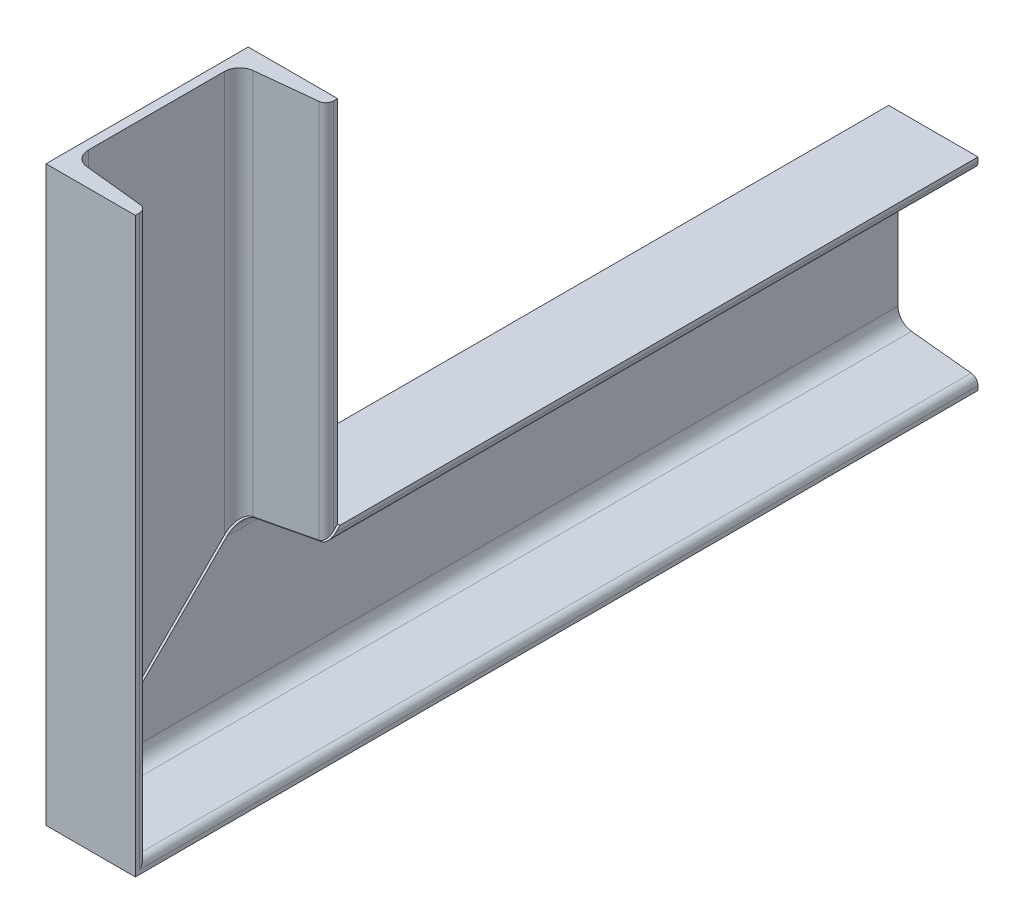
ISO-10303-21;
HEADER;
FILE_DESCRIPTION(('STEP AP214'),'2;1');
FILE_NAME('part.step','',(''),(''),'','','');
FILE_SCHEMA(('AUTOMOTIVE_DESIGN { 1 0 10303 214 1 1 1 1 }'));
ENDSEC;
DATA;
#1=APPLICATION_CONTEXT('core data for automotive mechanical design processes');
#2=APPLICATION_PROTOCOL_DEFINITION('international standard','automotive_design',2000,#1);
#3=PRODUCT_CONTEXT('',#1,'mechanical');
#4=PRODUCT('Part','Part','',(#3));
#5=PRODUCT_RELATED_PRODUCT_CATEGORY('part','',(#4));
#6=PRODUCT_DEFINITION_FORMATION('','',#4);
#7=PRODUCT_DEFINITION_CONTEXT('part definition',#1,'design');
#8=PRODUCT_DEFINITION('design','',#6,#7);
#9=PRODUCT_DEFINITION_SHAPE('','',#8);
#10=(LENGTH_UNIT() NAMED_UNIT(*) SI_UNIT(.MILLI.,.METRE.));
#11=(NAMED_UNIT(*) PLANE_ANGLE_UNIT() SI_UNIT($,.RADIAN.));
#12=(NAMED_UNIT(*) SI_UNIT($,.STERADIAN.) SOLID_ANGLE_UNIT());
#13=UNCERTAINTY_MEASURE_WITH_UNIT(LENGTH_MEASURE(1.E-05),#10,'distance_accuracy_value','');
#14=(GEOMETRIC_REPRESENTATION_CONTEXT(3) GLOBAL_UNCERTAINTY_ASSIGNED_CONTEXT((#13)) GLOBAL_UNIT_ASSIGNED_CONTEXT((#10,
#11,#12)) REPRESENTATION_CONTEXT('',''));
#15=CARTESIAN_POINT('',(0.,0.,0.));
#16=DIRECTION('',(0.,0.,1.));
#17=DIRECTION('',(1.,0.,0.));
#18=AXIS2_PLACEMENT_3D('',#15,#16,#17);
#19=CARTESIAN_POINT('',(53.,57.5511778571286,500.));
#20=DIRECTION('',(-1.,0.,0.));
#21=DIRECTION('',(0.,0.,1.));
#22=AXIS2_PLACEMENT_3D('',#19,#20,#21);
#23=PLANE('',#22);
#24=DIRECTION('',(0.,0.,-1.));
#25=VECTOR('',#24,1.);
#26=CARTESIAN_POINT('',(53.,60.,500.));
#27=LINE('',#26,#25);
#28=CARTESIAN_POINT('',(53.,60.,378.585786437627));
#29=VERTEX_POINT('',#28);
#30=CARTESIAN_POINT('',(53.,60.,0.));
#31=VERTEX_POINT('',#30);
#32=EDGE_CURVE('E353',#29,#31,#27,.T.);
#33=ORIENTED_EDGE('',*,*,#32,.F.);
#34=DIRECTION('',(0.,-0.707106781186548,0.707106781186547));
#35=VECTOR('',#34,1.);
#36=CARTESIAN_POINT('',(53.,-1.93151785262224,440.517304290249));
#37=LINE('',#36,#35);
#38=CARTESIAN_POINT('',(53.,57.5511778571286,381.034608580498));
#39=VERTEX_POINT('',#38);
#40=EDGE_CURVE('E238',#29,#39,#37,.T.);
#41=ORIENTED_EDGE('',*,*,#40,.T.);
#42=DIRECTION('',(0.,0.,-1.));
#43=VECTOR('',#42,1.);
#44=CARTESIAN_POINT('',(53.,57.5511778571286,500.));
#45=LINE('',#44,#43);
#46=CARTESIAN_POINT('',(53.,57.5511778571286,0.));
#47=VERTEX_POINT('',#46);
#48=EDGE_CURVE('E355',#39,#47,#45,.T.);
#49=ORIENTED_EDGE('',*,*,#48,.T.);
#50=DIRECTION('',(0.,1.,0.));
#51=VECTOR('',#50,1.);
#52=CARTESIAN_POINT('',(53.,57.5511778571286,0.));
#53=LINE('',#52,#51);
#54=EDGE_CURVE('E345',#47,#31,#53,.T.);
#55=ORIENTED_EDGE('',*,*,#54,.T.);
#56=EDGE_LOOP('',(#33,#41,#49,#55));
#57=FACE_BOUND('',#56,.T.);
#58=ADVANCED_FACE('F41',(#57),#23,.F.);
#59=DIRECTION('',(0.,0.,-1.));
#60=VECTOR('',#59,1.);
#61=CARTESIAN_POINT('',(53.,-57.5511778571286,500.));
#62=LINE('',#61,#60);
#63=CARTESIAN_POINT('',(53.,-57.5511778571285,497.551177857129));
#64=VERTEX_POINT('',#63);
#65=CARTESIAN_POINT('',(53.,-57.5511778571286,0.));
#66=VERTEX_POINT('',#65);
#67=EDGE_CURVE('E369',#64,#66,#62,.T.);
#68=ORIENTED_EDGE('',*,*,#67,.F.);
#69=DIRECTION('',(0.,-1.,0.));
#70=VECTOR('',#69,1.);
#71=CARTESIAN_POINT('',(53.,280.,497.551177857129));
#72=LINE('',#71,#70);
#73=CARTESIAN_POINT('',(53.,280.,497.551177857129));
#74=VERTEX_POINT('',#73);
#75=EDGE_CURVE('E279',#74,#64,#72,.T.);
#76=ORIENTED_EDGE('',*,*,#75,.F.);
#77=DIRECTION('',(0.,0.,1.));
#78=VECTOR('',#77,1.);
#79=CARTESIAN_POINT('',(53.,280.,497.551177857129));
#80=LINE('',#79,#78);
#81=CARTESIAN_POINT('',(53.,280.,500.));
#82=VERTEX_POINT('',#81);
#83=EDGE_CURVE('E276',#74,#82,#80,.T.);
#84=ORIENTED_EDGE('',*,*,#83,.T.);
#85=DIRECTION('',(0.,1.,0.));
#86=VECTOR('',#85,1.);
#87=CARTESIAN_POINT('',(53.,-60.,500.));
#88=LINE('',#87,#86);
#89=CARTESIAN_POINT('',(53.,-60.,500.));
#90=VERTEX_POINT('',#89);
#91=EDGE_CURVE('E351',#90,#82,#88,.T.);
#92=ORIENTED_EDGE('',*,*,#91,.F.);
#93=DIRECTION('',(0.,0.,-1.));
#94=VECTOR('',#93,1.);
#95=CARTESIAN_POINT('',(53.,-60.,500.));
#96=LINE('',#95,#94);
#97=CARTESIAN_POINT('',(53.,-60.,0.));
#98=VERTEX_POINT('',#97);
#99=EDGE_CURVE('E371',#90,#98,#96,.T.);
#100=ORIENTED_EDGE('',*,*,#99,.T.);
#101=DIRECTION('',(0.,1.,0.));
#102=VECTOR('',#101,1.);
#103=CARTESIAN_POINT('',(53.,-60.,0.));
#104=LINE('',#103,#102);
#105=EDGE_CURVE('E321',#98,#66,#104,.T.);
#106=ORIENTED_EDGE('',*,*,#105,.T.);
#107=EDGE_LOOP('',(#68,#76,#84,#92,#100,#106));
#108=FACE_BOUND('',#107,.T.);
#109=ADVANCED_FACE('F417',(#108),#23,.F.);
#110=DIRECTION('',(0.,-1.,0.));
#111=VECTOR('',#110,1.);
#112=CARTESIAN_POINT('',(53.,280.,382.448822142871));
#113=LINE('',#112,#111);
#114=CARTESIAN_POINT('',(53.,280.,382.448822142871));
#115=VERTEX_POINT('',#114);
#116=CARTESIAN_POINT('',(53.,58.9653914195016,382.448822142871));
#117=VERTEX_POINT('',#116);
#118=EDGE_CURVE('E297',#115,#117,#113,.T.);
#119=ORIENTED_EDGE('',*,*,#118,.T.);
#120=DIRECTION('',(0.,0.707106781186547,-0.707106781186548));
#121=VECTOR('',#120,1.);
#122=CARTESIAN_POINT('',(53.,-0.517304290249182,441.931517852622));
#123=LINE('',#122,#121);
#124=CARTESIAN_POINT('',(53.,61.4142135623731,380.));
#125=VERTEX_POINT('',#124);
#126=EDGE_CURVE('E218',#117,#125,#123,.T.);
#127=ORIENTED_EDGE('',*,*,#126,.T.);
#128=DIRECTION('',(0.,-1.,0.));
#129=VECTOR('',#128,1.);
#130=CARTESIAN_POINT('',(53.,280.,380.));
#131=LINE('',#130,#129);
#132=CARTESIAN_POINT('',(53.,280.,380.));
#133=VERTEX_POINT('',#132);
#134=EDGE_CURVE('E300',#133,#125,#131,.T.);
#135=ORIENTED_EDGE('',*,*,#134,.F.);
#136=DIRECTION('',(0.,0.,1.));
#137=VECTOR('',#136,1.);
#138=CARTESIAN_POINT('',(53.,280.,380.));
#139=LINE('',#138,#137);
#140=EDGE_CURVE('E252',#133,#115,#139,.T.);
#141=ORIENTED_EDGE('',*,*,#140,.T.);
#142=EDGE_LOOP('',(#119,#127,#135,#141));
#143=FACE_BOUND('',#142,.T.);
#144=ADVANCED_FACE('F447',(#143),#23,.F.);
#145=CARTESIAN_POINT('',(53.,60.,500.));
#146=DIRECTION('',(0.,-1.,0.));
#147=DIRECTION('',(0.,0.,-1.));
#148=AXIS2_PLACEMENT_3D('',#145,#146,#147);
#149=PLANE('',#148);
#150=DIRECTION('',(0.,0.,-1.));
#151=VECTOR('',#150,1.);
#152=CARTESIAN_POINT('',(0.,60.,500.));
#153=LINE('',#152,#151);
#154=CARTESIAN_POINT('',(0.,60.,378.585786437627));
#155=VERTEX_POINT('',#154);
#156=CARTESIAN_POINT('',(0.,60.,0.));
#157=VERTEX_POINT('',#156);
#158=EDGE_CURVE('E375',#155,#157,#153,.T.);
#159=ORIENTED_EDGE('',*,*,#158,.F.);
#160=DIRECTION('',(1.,0.,0.));
#161=VECTOR('',#160,1.);
#162=CARTESIAN_POINT('',(53.,60.,378.585786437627));
#163=LINE('',#162,#161);
#164=EDGE_CURVE('E241',#155,#29,#163,.T.);
#165=ORIENTED_EDGE('',*,*,#164,.T.);
#166=ORIENTED_EDGE('',*,*,#32,.T.);
#167=DIRECTION('',(-1.,0.,0.));
#168=VECTOR('',#167,1.);
#169=CARTESIAN_POINT('',(53.,60.,0.));
#170=LINE('',#169,#168);
#171=EDGE_CURVE('E312',#31,#157,#170,.T.);
#172=ORIENTED_EDGE('',*,*,#171,.T.);
#173=EDGE_LOOP('',(#159,#165,#166,#172));
#174=FACE_BOUND('',#173,.T.);
#175=ADVANCED_FACE('F43',(#174),#149,.F.);
#176=CARTESIAN_POINT('',(0.,60.,500.));
#177=DIRECTION('',(1.,0.,0.));
#178=DIRECTION('',(0.,1.,0.));
#179=AXIS2_PLACEMENT_3D('',#176,#177,#178);
#180=PLANE('',#179);
#181=DIRECTION('',(0.,0.707106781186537,0.707106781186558));
#182=VECTOR('',#181,1.);
#183=CARTESIAN_POINT('',(0.,-40.240947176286,478.826733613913));
#184=LINE('',#183,#182);
#185=CARTESIAN_POINT('',(0.,-40.240947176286,478.826733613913));
#186=VERTEX_POINT('',#185);
#187=CARTESIAN_POINT('',(0.,-38.8267336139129,480.240947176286));
#188=VERTEX_POINT('',#187);
#189=EDGE_CURVE('E204',#186,#188,#184,.T.);
#190=ORIENTED_EDGE('',*,*,#189,.F.);
#191=DIRECTION('',(0.,-0.707106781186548,0.707106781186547));
#192=VECTOR('',#191,1.);
#193=CARTESIAN_POINT('',(0.,73.6108187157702,364.974967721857));
#194=LINE('',#193,#192);
#195=EDGE_CURVE('E201',#155,#186,#194,.T.);
#196=ORIENTED_EDGE('',*,*,#195,.F.);
#197=ORIENTED_EDGE('',*,*,#158,.T.);
#198=DIRECTION('',(0.,-1.,0.));
#199=VECTOR('',#198,1.);
#200=CARTESIAN_POINT('',(0.,60.,0.));
#201=LINE('',#200,#199);
#202=CARTESIAN_POINT('',(0.,-60.,0.));
#203=VERTEX_POINT('',#202);
#204=EDGE_CURVE('E315',#157,#203,#201,.T.);
#205=ORIENTED_EDGE('',*,*,#204,.T.);
#206=DIRECTION('',(0.,0.,-1.));
#207=VECTOR('',#206,1.);
#208=CARTESIAN_POINT('',(0.,-60.,500.));
#209=LINE('',#208,#207);
#210=CARTESIAN_POINT('',(0.,-60.,500.));
#211=VERTEX_POINT('',#210);
#212=EDGE_CURVE('E373',#211,#203,#209,.T.);
#213=ORIENTED_EDGE('',*,*,#212,.F.);
#214=DIRECTION('',(0.,-1.,0.));
#215=VECTOR('',#214,1.);
#216=CARTESIAN_POINT('',(0.,60.,500.));
#217=LINE('',#216,#215);
#218=CARTESIAN_POINT('',(0.,280.,500.));
#219=VERTEX_POINT('',#218);
#220=EDGE_CURVE('E348',#219,#211,#217,.T.);
#221=ORIENTED_EDGE('',*,*,#220,.F.);
#222=DIRECTION('',(0.,0.,-1.));
#223=VECTOR('',#222,1.);
#224=CARTESIAN_POINT('',(0.,280.,500.));
#225=LINE('',#224,#223);
#226=CARTESIAN_POINT('',(0.,280.,380.));
#227=VERTEX_POINT('',#226);
#228=EDGE_CURVE('E247',#219,#227,#225,.T.);
#229=ORIENTED_EDGE('',*,*,#228,.T.);
#230=DIRECTION('',(0.,-1.,0.));
#231=VECTOR('',#230,1.);
#232=CARTESIAN_POINT('',(0.,280.,380.));
#233=LINE('',#232,#231);
#234=CARTESIAN_POINT('',(0.,61.414213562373,380.));
#235=VERTEX_POINT('',#234);
#236=EDGE_CURVE('E214',#227,#235,#233,.T.);
#237=ORIENTED_EDGE('',*,*,#236,.T.);
#238=DIRECTION('',(0.,0.707106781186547,-0.707106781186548));
#239=VECTOR('',#238,1.);
#240=CARTESIAN_POINT('',(0.,-38.8267336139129,480.240947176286));
#241=LINE('',#240,#239);
#242=EDGE_CURVE('E56',#188,#235,#241,.T.);
#243=ORIENTED_EDGE('',*,*,#242,.F.);
#244=EDGE_LOOP('',(#190,#196,#197,#205,#213,#221,#229,#237,#243));
#245=FACE_BOUND('',#244,.T.);
#246=ADVANCED_FACE('F212',(#245),#180,.F.);
#247=CARTESIAN_POINT('',(0.,-60.,500.));
#248=DIRECTION('',(0.,1.,0.));
#249=DIRECTION('',(0.,0.,1.));
#250=AXIS2_PLACEMENT_3D('',#247,#248,#249);
#251=PLANE('',#250);
#252=DIRECTION('',(1.,0.,0.));
#253=VECTOR('',#252,1.);
#254=CARTESIAN_POINT('',(0.,-60.,0.));
#255=LINE('',#254,#253);
#256=EDGE_CURVE('E318',#203,#98,#255,.T.);
#257=ORIENTED_EDGE('',*,*,#256,.T.);
#258=ORIENTED_EDGE('',*,*,#99,.F.);
#259=DIRECTION('',(1.,0.,0.));
#260=VECTOR('',#259,1.);
#261=CARTESIAN_POINT('',(0.,-60.,500.));
#262=LINE('',#261,#260);
#263=EDGE_CURVE('E64',#211,#90,#262,.T.);
#264=ORIENTED_EDGE('',*,*,#263,.F.);
#265=ORIENTED_EDGE('',*,*,#212,.T.);
#266=EDGE_LOOP('',(#257,#258,#264,#265));
#267=FACE_BOUND('',#266,.T.);
#268=ADVANCED_FACE('F405',(#267),#251,.F.);
#269=CARTESIAN_POINT('',(48.5,-57.5511778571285,500.));
#270=DIRECTION('',(0.,0.,-1.));
#271=DIRECTION('',(-1.,0.,0.));
#272=AXIS2_PLACEMENT_3D('',#269,#270,#271);
#273=CYLINDRICAL_SURFACE('',#272,4.5);
#274=CARTESIAN_POINT('',(48.5,-57.5511778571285,0.));
#275=DIRECTION('',(0.,0.,1.));
#276=DIRECTION('',(1.,0.,0.));
#277=AXIS2_PLACEMENT_3D('',#274,#275,#276);
#278=CIRCLE('',#277,4.5);
#279=CARTESIAN_POINT('',(48.9710815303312,-53.0759033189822,0.));
#280=VERTEX_POINT('',#279);
#281=EDGE_CURVE('E324',#66,#280,#278,.T.);
#282=ORIENTED_EDGE('',*,*,#281,.T.);
#283=DIRECTION('',(0.,0.,-1.));
#284=VECTOR('',#283,1.);
#285=CARTESIAN_POINT('',(48.9710815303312,-53.0759033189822,500.));
#286=LINE('',#285,#284);
#287=CARTESIAN_POINT('',(48.9710815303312,-53.0759033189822,493.075903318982));
#288=VERTEX_POINT('',#287);
#289=EDGE_CURVE('E367',#288,#280,#286,.T.);
#290=ORIENTED_EDGE('',*,*,#289,.F.);
#291=CARTESIAN_POINT('',(48.5,-57.5511778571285,497.551177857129));
#292=DIRECTION('',(0.,-0.707106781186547,-0.707106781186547));
#293=DIRECTION('',(0.,0.707106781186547,-0.707106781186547));
#294=AXIS2_PLACEMENT_3D('',#291,#292,#293);
#295=ELLIPSE('',#294,6.36396103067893,4.5);
#296=EDGE_CURVE('E281',#288,#64,#295,.T.);
#297=ORIENTED_EDGE('',*,*,#296,.T.);
#298=ORIENTED_EDGE('',*,*,#67,.T.);
#299=EDGE_LOOP('',(#282,#290,#297,#298));
#300=FACE_BOUND('',#299,.T.);
#301=ADVANCED_FACE('F477',(#300),#273,.T.);
#302=CARTESIAN_POINT('',(48.9710815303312,-53.0759033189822,500.));
#303=DIRECTION('',(-0.104684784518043,-0.994505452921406,0.));
#304=DIRECTION('',(0.994505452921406,-0.104684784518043,0.));
#305=AXIS2_PLACEMENT_3D('',#302,#303,#304);
#306=PLANE('',#305);
#307=DIRECTION('',(-0.994505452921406,0.104684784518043,0.));
#308=VECTOR('',#307,1.);
#309=CARTESIAN_POINT('',(48.9710815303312,-53.0759033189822,0.));
#310=LINE('',#309,#308);
#311=CARTESIAN_POINT('',(13.5578369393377,-49.3481933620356,0.));
#312=VERTEX_POINT('',#311);
#313=EDGE_CURVE('E327',#280,#312,#310,.T.);
#314=ORIENTED_EDGE('',*,*,#313,.T.);
#315=DIRECTION('',(0.,0.,-1.));
#316=VECTOR('',#315,1.);
#317=CARTESIAN_POINT('',(13.5578369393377,-49.3481933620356,500.));
#318=LINE('',#317,#316);
#319=CARTESIAN_POINT('',(13.5578369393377,-49.3481933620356,489.348193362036));
#320=VERTEX_POINT('',#319);
#321=EDGE_CURVE('E365',#320,#312,#318,.T.);
#322=ORIENTED_EDGE('',*,*,#321,.F.);
#323=DIRECTION('',(0.989100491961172,-0.104115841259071,0.10411584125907));
#324=VECTOR('',#323,1.);
#325=CARTESIAN_POINT('',(49.6841321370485,-53.1509612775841,493.150961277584));
#326=LINE('',#325,#324);
#327=EDGE_CURVE('E306',#320,#288,#326,.T.);
#328=ORIENTED_EDGE('',*,*,#327,.T.);
#329=ORIENTED_EDGE('',*,*,#289,.T.);
#330=EDGE_LOOP('',(#314,#322,#328,#329));
#331=FACE_BOUND('',#330,.T.);
#332=ADVANCED_FACE('F482',(#331),#306,.F.);
#333=CARTESIAN_POINT('',(14.5,-40.3976442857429,500.));
#334=DIRECTION('',(0.,0.,-1.));
#335=DIRECTION('',(-1.,0.,0.));
#336=AXIS2_PLACEMENT_3D('',#333,#334,#335);
#337=CYLINDRICAL_SURFACE('',#336,9.);
#338=CARTESIAN_POINT('',(14.5,-40.3976442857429,0.));
#339=DIRECTION('',(0.,0.,-1.));
#340=DIRECTION('',(-1.,0.,0.));
#341=AXIS2_PLACEMENT_3D('',#338,#339,#340);
#342=CIRCLE('',#341,9.);
#343=CARTESIAN_POINT('',(5.50000000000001,-40.3976442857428,0.));
#344=VERTEX_POINT('',#343);
#345=EDGE_CURVE('E330',#312,#344,#342,.T.);
#346=ORIENTED_EDGE('',*,*,#345,.T.);
#347=DIRECTION('',(0.,0.,-1.));
#348=VECTOR('',#347,1.);
#349=CARTESIAN_POINT('',(5.50000000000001,-40.3976442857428,500.));
#350=LINE('',#349,#348);
#351=CARTESIAN_POINT('',(5.50000000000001,-40.3976442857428,480.397644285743));
#352=VERTEX_POINT('',#351);
#353=EDGE_CURVE('E363',#352,#344,#350,.T.);
#354=ORIENTED_EDGE('',*,*,#353,.F.);
#355=CARTESIAN_POINT('',(14.5,-40.3976442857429,480.397644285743));
#356=DIRECTION('',(0.,-0.707106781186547,-0.707106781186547));
#357=DIRECTION('',(0.,0.707106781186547,-0.707106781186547));
#358=AXIS2_PLACEMENT_3D('',#355,#356,#357);
#359=ELLIPSE('',#358,12.7279220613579,9.);
#360=EDGE_CURVE('E309',#352,#320,#359,.F.);
#361=ORIENTED_EDGE('',*,*,#360,.T.);
#362=ORIENTED_EDGE('',*,*,#321,.T.);
#363=EDGE_LOOP('',(#346,#354,#361,#362));
#364=FACE_BOUND('',#363,.T.);
#365=ADVANCED_FACE('F486',(#364),#337,.F.);
#366=CARTESIAN_POINT('',(5.50000000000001,-40.3976442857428,500.));
#367=DIRECTION('',(-1.,0.,0.));
#368=DIRECTION('',(0.,-1.,0.));
#369=AXIS2_PLACEMENT_3D('',#366,#367,#368);
#370=PLANE('',#369);
#371=DIRECTION('',(0.,0.,-1.));
#372=VECTOR('',#371,1.);
#373=CARTESIAN_POINT('',(5.50000000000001,40.3976442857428,500.));
#374=LINE('',#373,#372);
#375=CARTESIAN_POINT('',(5.50000000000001,40.3976442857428,398.188142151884));
#376=VERTEX_POINT('',#375);
#377=CARTESIAN_POINT('',(5.50000000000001,40.3976442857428,0.));
#378=VERTEX_POINT('',#377);
#379=EDGE_CURVE('E361',#376,#378,#374,.T.);
#380=ORIENTED_EDGE('',*,*,#379,.F.);
#381=DIRECTION('',(0.,-0.707106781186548,0.707106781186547));
#382=VECTOR('',#381,1.);
#383=CARTESIAN_POINT('',(5.50000000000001,-50.905928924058,489.491715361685));
#384=LINE('',#383,#382);
#385=CARTESIAN_POINT('',(5.50000000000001,-40.240947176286,478.826733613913));
#386=VERTEX_POINT('',#385);
#387=EDGE_CURVE('E235',#376,#386,#384,.T.);
#388=ORIENTED_EDGE('',*,*,#387,.T.);
#389=DIRECTION('',(0.,0.707106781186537,0.707106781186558));
#390=VECTOR('',#389,1.);
#391=CARTESIAN_POINT('',(5.50000000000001,-29.7326625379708,489.335018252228));
#392=LINE('',#391,#390);
#393=CARTESIAN_POINT('',(5.50000000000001,-38.8267336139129,480.240947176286));
#394=VERTEX_POINT('',#393);
#395=EDGE_CURVE('E11',#386,#394,#392,.T.);
#396=ORIENTED_EDGE('',*,*,#395,.T.);
#397=DIRECTION('',(0.,0.707106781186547,-0.707106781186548));
#398=VECTOR('',#397,1.);
#399=CARTESIAN_POINT('',(5.50000000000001,-49.4917153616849,490.905928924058));
#400=LINE('',#399,#398);
#401=CARTESIAN_POINT('',(5.50000000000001,41.8118578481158,399.602355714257));
#402=VERTEX_POINT('',#401);
#403=EDGE_CURVE('E198',#394,#402,#400,.T.);
#404=ORIENTED_EDGE('',*,*,#403,.T.);
#405=DIRECTION('',(0.,-1.,0.));
#406=VECTOR('',#405,1.);
#407=CARTESIAN_POINT('',(5.50000000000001,280.,399.602355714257));
#408=LINE('',#407,#406);
#409=CARTESIAN_POINT('',(5.50000000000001,280.,399.602355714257));
#410=VERTEX_POINT('',#409);
#411=EDGE_CURVE('E288',#410,#402,#408,.T.);
#412=ORIENTED_EDGE('',*,*,#411,.F.);
#413=DIRECTION('',(0.,0.,1.));
#414=VECTOR('',#413,1.);
#415=CARTESIAN_POINT('',(5.50000000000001,280.,399.602355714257));
#416=LINE('',#415,#414);
#417=CARTESIAN_POINT('',(5.50000000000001,280.,480.397644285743));
#418=VERTEX_POINT('',#417);
#419=EDGE_CURVE('E264',#410,#418,#416,.T.);
#420=ORIENTED_EDGE('',*,*,#419,.T.);
#421=DIRECTION('',(0.,-1.,0.));
#422=VECTOR('',#421,1.);
#423=CARTESIAN_POINT('',(5.50000000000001,280.,480.397644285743));
#424=LINE('',#423,#422);
#425=EDGE_CURVE('E286',#418,#352,#424,.T.);
#426=ORIENTED_EDGE('',*,*,#425,.T.);
#427=ORIENTED_EDGE('',*,*,#353,.T.);
#428=DIRECTION('',(0.,1.,0.));
#429=VECTOR('',#428,1.);
#430=CARTESIAN_POINT('',(5.50000000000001,-40.3976442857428,0.));
#431=LINE('',#430,#429);
#432=EDGE_CURVE('E333',#344,#378,#431,.T.);
#433=ORIENTED_EDGE('',*,*,#432,.T.);
#434=EDGE_LOOP('',(#380,#388,#396,#404,#412,#420,#426,#427,#433));
#435=FACE_BOUND('',#434,.T.);
#436=ADVANCED_FACE('F434',(#435),#370,.F.);
#437=CARTESIAN_POINT('',(14.5,40.3976442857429,500.));
#438=DIRECTION('',(0.,0.,-1.));
#439=DIRECTION('',(-1.,0.,0.));
#440=AXIS2_PLACEMENT_3D('',#437,#438,#439);
#441=CYLINDRICAL_SURFACE('',#440,9.);
#442=DIRECTION('',(0.,0.,-1.));
#443=VECTOR('',#442,1.);
#444=CARTESIAN_POINT('',(13.5578369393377,49.3481933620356,500.));
#445=LINE('',#444,#443);
#446=CARTESIAN_POINT('',(13.5578369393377,49.3481933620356,389.237593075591));
#447=VERTEX_POINT('',#446);
#448=CARTESIAN_POINT('',(13.5578369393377,49.3481933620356,0.));
#449=VERTEX_POINT('',#448);
#450=EDGE_CURVE('E359',#447,#449,#445,.T.);
#451=ORIENTED_EDGE('',*,*,#450,.F.);
#452=CARTESIAN_POINT('',(14.5,40.3976442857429,398.188142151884));
#453=DIRECTION('',(0.,-0.707106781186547,-0.707106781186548));
#454=DIRECTION('',(0.,0.707106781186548,-0.707106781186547));
#455=AXIS2_PLACEMENT_3D('',#452,#453,#454);
#456=ELLIPSE('',#455,12.7279220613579,9.);
#457=EDGE_CURVE('E232',#447,#376,#456,.F.);
#458=ORIENTED_EDGE('',*,*,#457,.T.);
#459=ORIENTED_EDGE('',*,*,#379,.T.);
#460=CARTESIAN_POINT('',(14.5,40.3976442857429,0.));
#461=DIRECTION('',(0.,0.,-1.));
#462=DIRECTION('',(-1.,0.,0.));
#463=AXIS2_PLACEMENT_3D('',#460,#461,#462);
#464=CIRCLE('',#463,9.);
#465=EDGE_CURVE('E336',#378,#449,#464,.T.);
#466=ORIENTED_EDGE('',*,*,#465,.T.);
#467=EDGE_LOOP('',(#451,#458,#459,#466));
#468=FACE_BOUND('',#467,.T.);
#469=ADVANCED_FACE('F493',(#468),#441,.F.);
#470=CARTESIAN_POINT('',(13.5578369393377,49.3481933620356,500.));
#471=DIRECTION('',(-0.104684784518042,0.994505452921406,0.));
#472=DIRECTION('',(-0.994505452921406,-0.104684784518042,0.));
#473=AXIS2_PLACEMENT_3D('',#470,#471,#472);
#474=PLANE('',#473);
#475=DIRECTION('',(0.,0.,-1.));
#476=VECTOR('',#475,1.);
#477=CARTESIAN_POINT('',(48.9710815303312,53.0759033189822,500.));
#478=LINE('',#477,#476);
#479=CARTESIAN_POINT('',(48.9710815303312,53.0759033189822,385.509883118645));
#480=VERTEX_POINT('',#479);
#481=CARTESIAN_POINT('',(48.9710815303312,53.0759033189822,0.));
#482=VERTEX_POINT('',#481);
#483=EDGE_CURVE('E357',#480,#482,#478,.T.);
#484=ORIENTED_EDGE('',*,*,#483,.F.);
#485=DIRECTION('',(-0.989100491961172,-0.10411584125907,0.10411584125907));
#486=VECTOR('',#485,1.);
#487=CARTESIAN_POINT('',(2.15141020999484,48.14751686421,390.438269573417));
#488=LINE('',#487,#486);
#489=EDGE_CURVE('E229',#480,#447,#488,.T.);
#490=ORIENTED_EDGE('',*,*,#489,.T.);
#491=ORIENTED_EDGE('',*,*,#450,.T.);
#492=DIRECTION('',(0.994505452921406,0.104684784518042,0.));
#493=VECTOR('',#492,1.);
#494=CARTESIAN_POINT('',(13.5578369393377,49.3481933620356,0.));
#495=LINE('',#494,#493);
#496=EDGE_CURVE('E339',#449,#482,#495,.T.);
#497=ORIENTED_EDGE('',*,*,#496,.T.);
#498=EDGE_LOOP('',(#484,#490,#491,#497));
#499=FACE_BOUND('',#498,.T.);
#500=ADVANCED_FACE('F385',(#499),#474,.F.);
#501=CARTESIAN_POINT('',(48.5,57.5511778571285,500.));
#502=DIRECTION('',(0.,0.,-1.));
#503=DIRECTION('',(-1.,0.,0.));
#504=AXIS2_PLACEMENT_3D('',#501,#502,#503);
#505=CYLINDRICAL_SURFACE('',#504,4.5);
#506=ORIENTED_EDGE('',*,*,#48,.F.);
#507=CARTESIAN_POINT('',(48.5,57.5511778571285,381.034608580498));
#508=DIRECTION('',(0.,-0.707106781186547,-0.707106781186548));
#509=DIRECTION('',(0.,0.707106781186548,-0.707106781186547));
#510=AXIS2_PLACEMENT_3D('',#507,#508,#509);
#511=ELLIPSE('',#510,6.36396103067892,4.5);
#512=EDGE_CURVE('E49',#39,#480,#511,.T.);
#513=ORIENTED_EDGE('',*,*,#512,.T.);
#514=ORIENTED_EDGE('',*,*,#483,.T.);
#515=CARTESIAN_POINT('',(48.5,57.5511778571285,0.));
#516=DIRECTION('',(0.,0.,1.));
#517=DIRECTION('',(1.,0.,0.));
#518=AXIS2_PLACEMENT_3D('',#515,#516,#517);
#519=CIRCLE('',#518,4.5);
#520=EDGE_CURVE('E342',#482,#47,#519,.T.);
#521=ORIENTED_EDGE('',*,*,#520,.T.);
#522=EDGE_LOOP('',(#506,#513,#514,#521));
#523=FACE_BOUND('',#522,.T.);
#524=ADVANCED_FACE('F382',(#523),#505,.T.);
#525=CARTESIAN_POINT('',(48.5,-57.5511778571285,500.));
#526=DIRECTION('',(0.,0.,1.));
#527=DIRECTION('',(1.,0.,0.));
#528=AXIS2_PLACEMENT_3D('',#525,#526,#527);
#529=PLANE('',#528);
#530=ORIENTED_EDGE('',*,*,#91,.T.);
#531=DIRECTION('',(-1.,0.,0.));
#532=VECTOR('',#531,1.);
#533=CARTESIAN_POINT('',(53.,280.,500.));
#534=LINE('',#533,#532);
#535=EDGE_CURVE('E244',#82,#219,#534,.T.);
#536=ORIENTED_EDGE('',*,*,#535,.T.);
#537=ORIENTED_EDGE('',*,*,#220,.T.);
#538=ORIENTED_EDGE('',*,*,#263,.T.);
#539=EDGE_LOOP('',(#530,#536,#537,#538));
#540=FACE_BOUND('',#539,.T.);
#541=ADVANCED_FACE('F414',(#540),#529,.T.);
#542=CARTESIAN_POINT('',(48.5,-57.5511778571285,0.));
#543=DIRECTION('',(0.,0.,1.));
#544=DIRECTION('',(1.,0.,0.));
#545=AXIS2_PLACEMENT_3D('',#542,#543,#544);
#546=PLANE('',#545);
#547=ORIENTED_EDGE('',*,*,#171,.F.);
#548=ORIENTED_EDGE('',*,*,#54,.F.);
#549=ORIENTED_EDGE('',*,*,#520,.F.);
#550=ORIENTED_EDGE('',*,*,#496,.F.);
#551=ORIENTED_EDGE('',*,*,#465,.F.);
#552=ORIENTED_EDGE('',*,*,#432,.F.);
#553=ORIENTED_EDGE('',*,*,#345,.F.);
#554=ORIENTED_EDGE('',*,*,#313,.F.);
#555=ORIENTED_EDGE('',*,*,#281,.F.);
#556=ORIENTED_EDGE('',*,*,#105,.F.);
#557=ORIENTED_EDGE('',*,*,#256,.F.);
#558=ORIENTED_EDGE('',*,*,#204,.F.);
#559=EDGE_LOOP('',(#547,#548,#549,#550,#551,#552,#553,#554,#555,#556,#557,#558));
#560=FACE_BOUND('',#559,.T.);
#561=ADVANCED_FACE('F393',(#560),#546,.F.);
#562=CARTESIAN_POINT('',(14.5,280.,480.397644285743));
#563=DIRECTION('',(0.,-1.,0.));
#564=DIRECTION('',(0.,0.,-1.));
#565=AXIS2_PLACEMENT_3D('',#562,#563,#564);
#566=CYLINDRICAL_SURFACE('',#565,9.00000000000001);
#567=DIRECTION('',(0.,-1.,0.));
#568=VECTOR('',#567,1.);
#569=CARTESIAN_POINT('',(13.5578369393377,280.,489.348193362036));
#570=LINE('',#569,#568);
#571=CARTESIAN_POINT('',(13.5578369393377,280.,489.348193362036));
#572=VERTEX_POINT('',#571);
#573=EDGE_CURVE('E284',#572,#320,#570,.T.);
#574=ORIENTED_EDGE('',*,*,#573,.T.);
#575=ORIENTED_EDGE('',*,*,#360,.F.);
#576=ORIENTED_EDGE('',*,*,#425,.F.);
#577=CARTESIAN_POINT('',(14.5,280.,480.397644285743));
#578=DIRECTION('',(0.,1.,0.));
#579=DIRECTION('',(0.,0.,1.));
#580=AXIS2_PLACEMENT_3D('',#577,#578,#579);
#581=CIRCLE('',#580,9.00000000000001);
#582=EDGE_CURVE('E267',#418,#572,#581,.T.);
#583=ORIENTED_EDGE('',*,*,#582,.T.);
#584=EDGE_LOOP('',(#574,#575,#576,#583));
#585=FACE_BOUND('',#584,.T.);
#586=ADVANCED_FACE('F428',(#585),#566,.F.);
#587=CARTESIAN_POINT('',(14.5,280.,399.602355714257));
#588=DIRECTION('',(0.,-1.,0.));
#589=DIRECTION('',(0.,0.,-1.));
#590=AXIS2_PLACEMENT_3D('',#587,#588,#589);
#591=CYLINDRICAL_SURFACE('',#590,9.00000000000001);
#592=CARTESIAN_POINT('',(14.5,41.8118578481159,399.602355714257));
#593=DIRECTION('',(0.,0.707106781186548,0.707106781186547));
#594=DIRECTION('',(0.,-0.707106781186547,0.707106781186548));
#595=AXIS2_PLACEMENT_3D('',#592,#593,#594);
#596=ELLIPSE('',#595,12.7279220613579,9.00000000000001);
#597=CARTESIAN_POINT('',(13.5578369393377,50.7624069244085,390.651806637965));
#598=VERTEX_POINT('',#597);
#599=EDGE_CURVE('E226',#598,#402,#596,.T.);
#600=ORIENTED_EDGE('',*,*,#599,.F.);
#601=DIRECTION('',(0.,-1.,0.));
#602=VECTOR('',#601,1.);
#603=CARTESIAN_POINT('',(13.5578369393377,280.,390.651806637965));
#604=LINE('',#603,#602);
#605=CARTESIAN_POINT('',(13.5578369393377,280.,390.651806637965));
#606=VERTEX_POINT('',#605);
#607=EDGE_CURVE('E291',#606,#598,#604,.T.);
#608=ORIENTED_EDGE('',*,*,#607,.F.);
#609=CARTESIAN_POINT('',(14.5,280.,399.602355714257));
#610=DIRECTION('',(0.,1.,0.));
#611=DIRECTION('',(0.,0.,1.));
#612=AXIS2_PLACEMENT_3D('',#609,#610,#611);
#613=CIRCLE('',#612,9.00000000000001);
#614=EDGE_CURVE('E261',#606,#410,#613,.T.);
#615=ORIENTED_EDGE('',*,*,#614,.T.);
#616=ORIENTED_EDGE('',*,*,#411,.T.);
#617=EDGE_LOOP('',(#600,#608,#615,#616));
#618=FACE_BOUND('',#617,.T.);
#619=ADVANCED_FACE('F437',(#618),#591,.F.);
#620=CARTESIAN_POINT('',(13.5578369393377,280.,489.348193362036));
#621=DIRECTION('',(0.104684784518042,0.,-0.994505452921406));
#622=DIRECTION('',(-0.994505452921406,0.,-0.104684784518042));
#623=AXIS2_PLACEMENT_3D('',#620,#621,#622);
#624=PLANE('',#623);
#625=DIRECTION('',(0.,-1.,0.));
#626=VECTOR('',#625,1.);
#627=CARTESIAN_POINT('',(48.9710815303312,280.,493.075903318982));
#628=LINE('',#627,#626);
#629=CARTESIAN_POINT('',(48.9710815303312,280.,493.075903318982));
#630=VERTEX_POINT('',#629);
#631=EDGE_CURVE('E282',#630,#288,#628,.T.);
#632=ORIENTED_EDGE('',*,*,#631,.T.);
#633=ORIENTED_EDGE('',*,*,#327,.F.);
#634=ORIENTED_EDGE('',*,*,#573,.F.);
#635=DIRECTION('',(0.994505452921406,0.,0.104684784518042));
#636=VECTOR('',#635,1.);
#637=CARTESIAN_POINT('',(13.5578369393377,280.,489.348193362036));
#638=LINE('',#637,#636);
#639=EDGE_CURVE('E270',#572,#630,#638,.T.);
#640=ORIENTED_EDGE('',*,*,#639,.T.);
#641=EDGE_LOOP('',(#632,#633,#634,#640));
#642=FACE_BOUND('',#641,.T.);
#643=ADVANCED_FACE('F423',(#642),#624,.T.);
#644=CARTESIAN_POINT('',(48.9710815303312,280.,386.924096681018));
#645=DIRECTION('',(0.104684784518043,0.,0.994505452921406));
#646=DIRECTION('',(0.994505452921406,0.,-0.104684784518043));
#647=AXIS2_PLACEMENT_3D('',#644,#645,#646);
#648=PLANE('',#647);
#649=DIRECTION('',(-0.989100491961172,-0.104115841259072,0.104115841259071));
#650=VECTOR('',#649,1.);
#651=CARTESIAN_POINT('',(72.1943215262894,56.9346684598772,384.479545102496));
#652=LINE('',#651,#650);
#653=CARTESIAN_POINT('',(48.9710815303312,54.4901168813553,386.924096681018));
#654=VERTEX_POINT('',#653);
#655=EDGE_CURVE('E224',#654,#598,#652,.T.);
#656=ORIENTED_EDGE('',*,*,#655,.F.);
#657=DIRECTION('',(0.,-1.,0.));
#658=VECTOR('',#657,1.);
#659=CARTESIAN_POINT('',(48.9710815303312,280.,386.924096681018));
#660=LINE('',#659,#658);
#661=CARTESIAN_POINT('',(48.9710815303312,280.,386.924096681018));
#662=VERTEX_POINT('',#661);
#663=EDGE_CURVE('E294',#662,#654,#660,.T.);
#664=ORIENTED_EDGE('',*,*,#663,.F.);
#665=DIRECTION('',(-0.994505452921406,0.,0.104684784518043));
#666=VECTOR('',#665,1.);
#667=CARTESIAN_POINT('',(48.9710815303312,280.,386.924096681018));
#668=LINE('',#667,#666);
#669=EDGE_CURVE('E258',#662,#606,#668,.T.);
#670=ORIENTED_EDGE('',*,*,#669,.T.);
#671=ORIENTED_EDGE('',*,*,#607,.T.);
#672=EDGE_LOOP('',(#656,#664,#670,#671));
#673=FACE_BOUND('',#672,.T.);
#674=ADVANCED_FACE('F442',(#673),#648,.T.);
#675=CARTESIAN_POINT('',(48.5,280.,497.551177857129));
#676=DIRECTION('',(0.,-1.,0.));
#677=DIRECTION('',(0.,0.,-1.));
#678=AXIS2_PLACEMENT_3D('',#675,#676,#677);
#679=CYLINDRICAL_SURFACE('',#678,4.5);
#680=ORIENTED_EDGE('',*,*,#75,.T.);
#681=ORIENTED_EDGE('',*,*,#296,.F.);
#682=ORIENTED_EDGE('',*,*,#631,.F.);
#683=CARTESIAN_POINT('',(48.5,280.,497.551177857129));
#684=DIRECTION('',(0.,-1.,0.));
#685=DIRECTION('',(0.,0.,-1.));
#686=AXIS2_PLACEMENT_3D('',#683,#684,#685);
#687=CIRCLE('',#686,4.5);
#688=EDGE_CURVE('E273',#630,#74,#687,.T.);
#689=ORIENTED_EDGE('',*,*,#688,.T.);
#690=EDGE_LOOP('',(#680,#681,#682,#689));
#691=FACE_BOUND('',#690,.T.);
#692=ADVANCED_FACE('F457',(#691),#679,.T.);
#693=CARTESIAN_POINT('',(48.5,280.,382.448822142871));
#694=DIRECTION('',(0.,-1.,0.));
#695=DIRECTION('',(0.,0.,-1.));
#696=AXIS2_PLACEMENT_3D('',#693,#694,#695);
#697=CYLINDRICAL_SURFACE('',#696,4.5);
#698=CARTESIAN_POINT('',(48.5,58.9653914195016,382.448822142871));
#699=DIRECTION('',(0.,0.707106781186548,0.707106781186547));
#700=DIRECTION('',(0.,-0.707106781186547,0.707106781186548));
#701=AXIS2_PLACEMENT_3D('',#698,#699,#700);
#702=ELLIPSE('',#701,6.36396103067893,4.5);
#703=EDGE_CURVE('E222',#117,#654,#702,.F.);
#704=ORIENTED_EDGE('',*,*,#703,.F.);
#705=ORIENTED_EDGE('',*,*,#118,.F.);
#706=CARTESIAN_POINT('',(48.5,280.,382.448822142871));
#707=DIRECTION('',(0.,-1.,0.));
#708=DIRECTION('',(0.,0.,-1.));
#709=AXIS2_PLACEMENT_3D('',#706,#707,#708);
#710=CIRCLE('',#709,4.5);
#711=EDGE_CURVE('E255',#115,#662,#710,.T.);
#712=ORIENTED_EDGE('',*,*,#711,.T.);
#713=ORIENTED_EDGE('',*,*,#663,.T.);
#714=EDGE_LOOP('',(#704,#705,#712,#713));
#715=FACE_BOUND('',#714,.T.);
#716=ADVANCED_FACE('F445',(#715),#697,.T.);
#717=CARTESIAN_POINT('',(0.,280.,380.));
#718=DIRECTION('',(0.,0.,-1.));
#719=DIRECTION('',(-1.,0.,0.));
#720=AXIS2_PLACEMENT_3D('',#717,#718,#719);
#721=PLANE('',#720);
#722=DIRECTION('',(1.,0.,0.));
#723=VECTOR('',#722,1.);
#724=CARTESIAN_POINT('',(0.,61.4142135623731,380.));
#725=LINE('',#724,#723);
#726=EDGE_CURVE('E377',#235,#125,#725,.T.);
#727=ORIENTED_EDGE('',*,*,#726,.F.);
#728=ORIENTED_EDGE('',*,*,#236,.F.);
#729=DIRECTION('',(1.,0.,0.));
#730=VECTOR('',#729,1.);
#731=CARTESIAN_POINT('',(0.,280.,380.));
#732=LINE('',#731,#730);
#733=EDGE_CURVE('E249',#227,#133,#732,.T.);
#734=ORIENTED_EDGE('',*,*,#733,.T.);
#735=ORIENTED_EDGE('',*,*,#134,.T.);
#736=EDGE_LOOP('',(#727,#728,#734,#735));
#737=FACE_BOUND('',#736,.T.);
#738=ADVANCED_FACE('F449',(#737),#721,.T.);
#739=CARTESIAN_POINT('',(48.5,280.,382.448822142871));
#740=DIRECTION('',(0.,-1.,0.));
#741=DIRECTION('',(0.,0.,-1.));
#742=AXIS2_PLACEMENT_3D('',#739,#740,#741);
#743=PLANE('',#742);
#744=ORIENTED_EDGE('',*,*,#535,.F.);
#745=ORIENTED_EDGE('',*,*,#83,.F.);
#746=ORIENTED_EDGE('',*,*,#688,.F.);
#747=ORIENTED_EDGE('',*,*,#639,.F.);
#748=ORIENTED_EDGE('',*,*,#582,.F.);
#749=ORIENTED_EDGE('',*,*,#419,.F.);
#750=ORIENTED_EDGE('',*,*,#614,.F.);
#751=ORIENTED_EDGE('',*,*,#669,.F.);
#752=ORIENTED_EDGE('',*,*,#711,.F.);
#753=ORIENTED_EDGE('',*,*,#140,.F.);
#754=ORIENTED_EDGE('',*,*,#733,.F.);
#755=ORIENTED_EDGE('',*,*,#228,.F.);
#756=EDGE_LOOP('',(#744,#745,#746,#747,#748,#749,#750,#751,#752,#753,#754,#755));
#757=FACE_BOUND('',#756,.T.);
#758=ADVANCED_FACE('F411',(#757),#743,.F.);
#759=CARTESIAN_POINT('',(60.,-40.240947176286,478.826733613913));
#760=DIRECTION('',(0.,-0.707106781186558,0.707106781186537));
#761=DIRECTION('',(0.,-0.707106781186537,-0.707106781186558));
#762=AXIS2_PLACEMENT_3D('',#759,#760,#761);
#763=PLANE('',#762);
#764=DIRECTION('',(-1.,0.,0.));
#765=VECTOR('',#764,1.);
#766=CARTESIAN_POINT('',(60.,-40.240947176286,478.826733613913));
#767=LINE('',#766,#765);
#768=EDGE_CURVE('E200',#386,#186,#767,.T.);
#769=ORIENTED_EDGE('',*,*,#768,.T.);
#770=ORIENTED_EDGE('',*,*,#189,.T.);
#771=DIRECTION('',(-1.,0.,0.));
#772=VECTOR('',#771,1.);
#773=CARTESIAN_POINT('',(60.,-38.8267336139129,480.240947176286));
#774=LINE('',#773,#772);
#775=EDGE_CURVE('E194',#394,#188,#774,.T.);
#776=ORIENTED_EDGE('',*,*,#775,.F.);
#777=ORIENTED_EDGE('',*,*,#395,.F.);
#778=EDGE_LOOP('',(#769,#770,#776,#777));
#779=FACE_BOUND('',#778,.T.);
#780=ADVANCED_FACE('F205',(#779),#763,.F.);
#781=CARTESIAN_POINT('',(60.,73.6108187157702,364.974967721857));
#782=DIRECTION('',(0.,-0.707106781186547,-0.707106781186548));
#783=DIRECTION('',(0.,0.707106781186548,-0.707106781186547));
#784=AXIS2_PLACEMENT_3D('',#781,#782,#783);
#785=PLANE('',#784);
#786=ORIENTED_EDGE('',*,*,#195,.T.);
#787=ORIENTED_EDGE('',*,*,#768,.F.);
#788=ORIENTED_EDGE('',*,*,#387,.F.);
#789=ORIENTED_EDGE('',*,*,#457,.F.);
#790=ORIENTED_EDGE('',*,*,#489,.F.);
#791=ORIENTED_EDGE('',*,*,#512,.F.);
#792=ORIENTED_EDGE('',*,*,#40,.F.);
#793=ORIENTED_EDGE('',*,*,#164,.F.);
#794=EDGE_LOOP('',(#786,#787,#788,#789,#790,#791,#792,#793));
#795=FACE_BOUND('',#794,.T.);
#796=ADVANCED_FACE('F397',(#795),#785,.F.);
#797=CARTESIAN_POINT('',(60.,-38.8267336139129,480.240947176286));
#798=DIRECTION('',(0.,0.707106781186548,0.707106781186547));
#799=DIRECTION('',(0.,-0.707106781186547,0.707106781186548));
#800=AXIS2_PLACEMENT_3D('',#797,#798,#799);
#801=PLANE('',#800);
#802=ORIENTED_EDGE('',*,*,#775,.T.);
#803=ORIENTED_EDGE('',*,*,#242,.T.);
#804=ORIENTED_EDGE('',*,*,#726,.T.);
#805=ORIENTED_EDGE('',*,*,#126,.F.);
#806=ORIENTED_EDGE('',*,*,#703,.T.);
#807=ORIENTED_EDGE('',*,*,#655,.T.);
#808=ORIENTED_EDGE('',*,*,#599,.T.);
#809=ORIENTED_EDGE('',*,*,#403,.F.);
#810=EDGE_LOOP('',(#802,#803,#804,#805,#806,#807,#808,#809));
#811=FACE_BOUND('',#810,.T.);
#812=ADVANCED_FACE('F196',(#811),#801,.F.);
#813=CLOSED_SHELL('',(#58,#109,#144,#175,#246,#268,#301,#332,#365,#436,#469,#500,#524,#541,#561,
#586,#619,#643,#674,#692,#716,#738,#758,#780,#796,#812));
#814=MANIFOLD_SOLID_BREP('B2',#813);
#815=ADVANCED_BREP_SHAPE_REPRESENTATION('',(#18,#814),#14);
#816=SHAPE_DEFINITION_REPRESENTATION(#9,#815);
ENDSEC;
END-ISO-10303-21;
